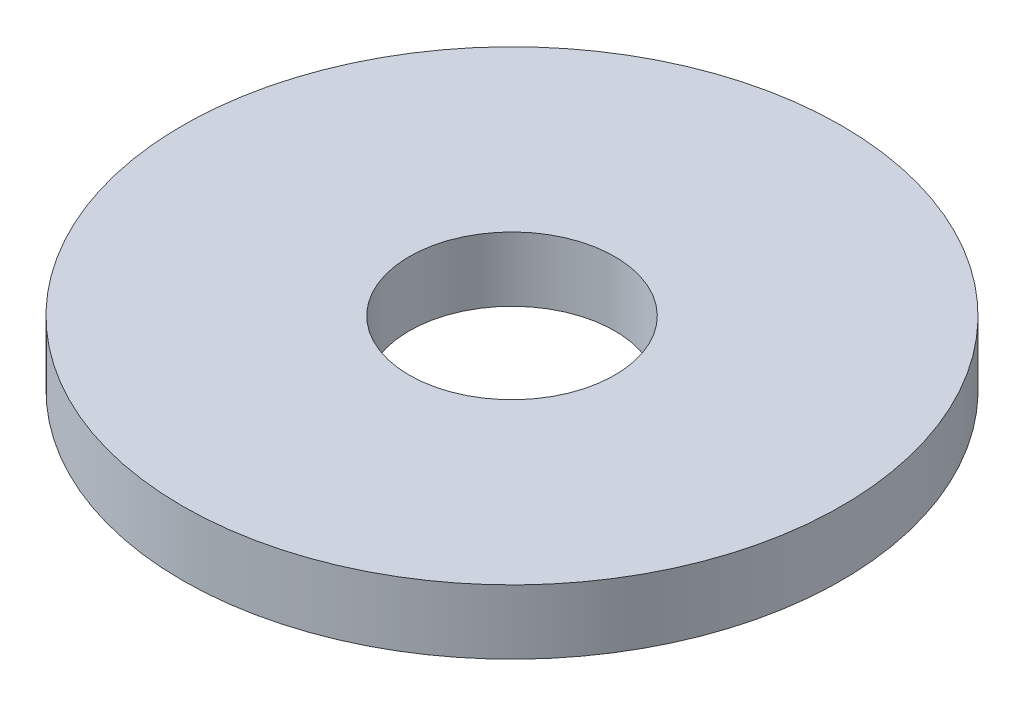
from build123d import *

# Parameters (mm, degrees)
SKETCH1_R           = 8.0645
SKETCH1_R_2         = 2.5146
BOSS_EXTRUDE1_DEPTH = 1.5748


with BuildPart() as part:
    # Sketch1 → Boss-Extrude1 (new body)
    with BuildSketch(Plane(origin=(0, 0, 0), x_dir=(1, 0, 0), z_dir=(0, 1, 0))):
        with Locations(Location((0, 0, 0), (0, 0, 270))):
            Circle(SKETCH1_R)
        with Locations(Location((0, 0, 0), (0, 0, 270))):
            Circle(SKETCH1_R_2, mode=Mode.SUBTRACT)
    extrude(amount=BOSS_EXTRUDE1_DEPTH)


solid = part.part
